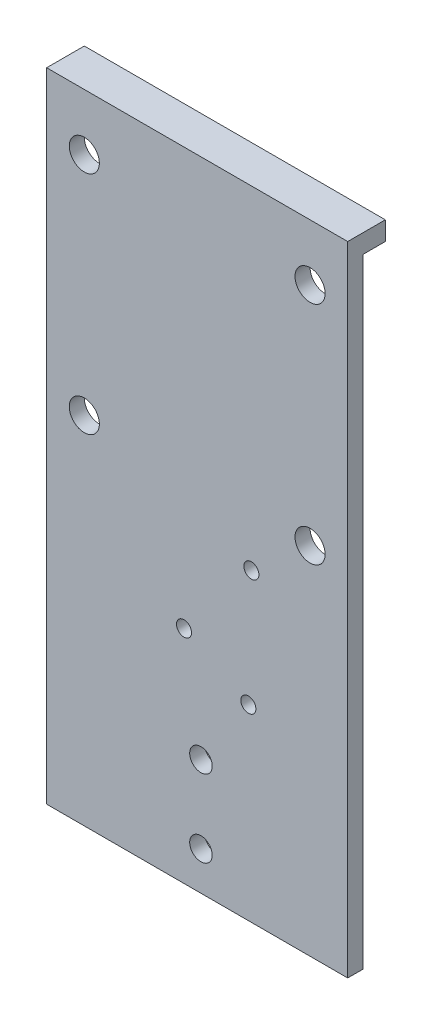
from build123d import *

# Parameters (mm, degrees)
ESQUISSE1_W             = 80
ESQUISSE1_H             = 169.5
BOSS_EXTRU_1_DEPTH      = 4
ESQUISSE2_R             = 4
ENL_V_MAT_EXTRU_1_DEPTH = 130.153905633
ESQUISSE5_R             = 3
ENL_V_MAT_EXTRU_2_DEPTH = 130.153905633
ESQUISSE6_W             = 80
ESQUISSE6_H             = 5
BOSS_EXTRU_2_DEPTH      = 6
ESQUISSE7_R             = 2
ENL_V_MAT_EXTRU_5_DEPTH = 130.47869068


with BuildPart() as part:
    # Esquisse1 → Boss.-Extru.1 (new body)
    with BuildSketch(Plane.XY):
        with Locations((10.990966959, -33.844488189)):
            Rectangle(ESQUISSE1_W, ESQUISSE1_H)
    extrude(amount=BOSS_EXTRU_1_DEPTH)

    # Esquisse2 → Enl_v. mat.-Extru.1 (cut, through all)
    with BuildSketch(Plane.XY.offset(4)):
        with Locations((-19.009033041, 35.905511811)):
            Circle(ESQUISSE2_R)
        with Locations((40.990966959, 35.905511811)):
            Circle(ESQUISSE2_R)
        with Locations((-19.009033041, -24.094488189)):
            Circle(ESQUISSE2_R)
        with Locations((40.990966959, -24.094488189)):
            Circle(ESQUISSE2_R)
    extrude(amount=-ENL_V_MAT_EXTRU_1_DEPTH, mode=Mode.SUBTRACT)

    # Esquisse5 → Enl_v. mat.-Extru.2 (cut, through all)
    with BuildSketch(Plane.XY.offset(4)):
        with Locations((11.990966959, -108.344488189)):
            Circle(ESQUISSE5_R)
        with Locations((11.990966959, -87.844488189)):
            Circle(ESQUISSE5_R)
    extrude(amount=-ENL_V_MAT_EXTRU_2_DEPTH, mode=Mode.SUBTRACT)

    # Esquisse6 → Boss.-Extru.2 (add)
    with BuildSketch(Plane(origin=(0, 0, 0), x_dir=(-1, 0, 0), z_dir=(0, 0, -1))):
        with Locations((-10.990966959, 48.405511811)):
            Rectangle(ESQUISSE6_W, ESQUISSE6_H)
    extrude(amount=BOSS_EXTRU_2_DEPTH)

    # Esquisse7 → Enl_v. mat.-Extru.5 (cut, through all)
    with BuildSketch(Plane.XY.offset(4)):
        with Locations((7.490966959, -59.894488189)):
            Circle(ESQUISSE7_R)
        with Locations((25.390966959, -37.594488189)):
            Circle(ESQUISSE7_R)
        with Locations((24.590966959, -68.874488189)):
            Circle(ESQUISSE7_R)
    extrude(amount=-ENL_V_MAT_EXTRU_5_DEPTH, mode=Mode.SUBTRACT)


solid = part.part
